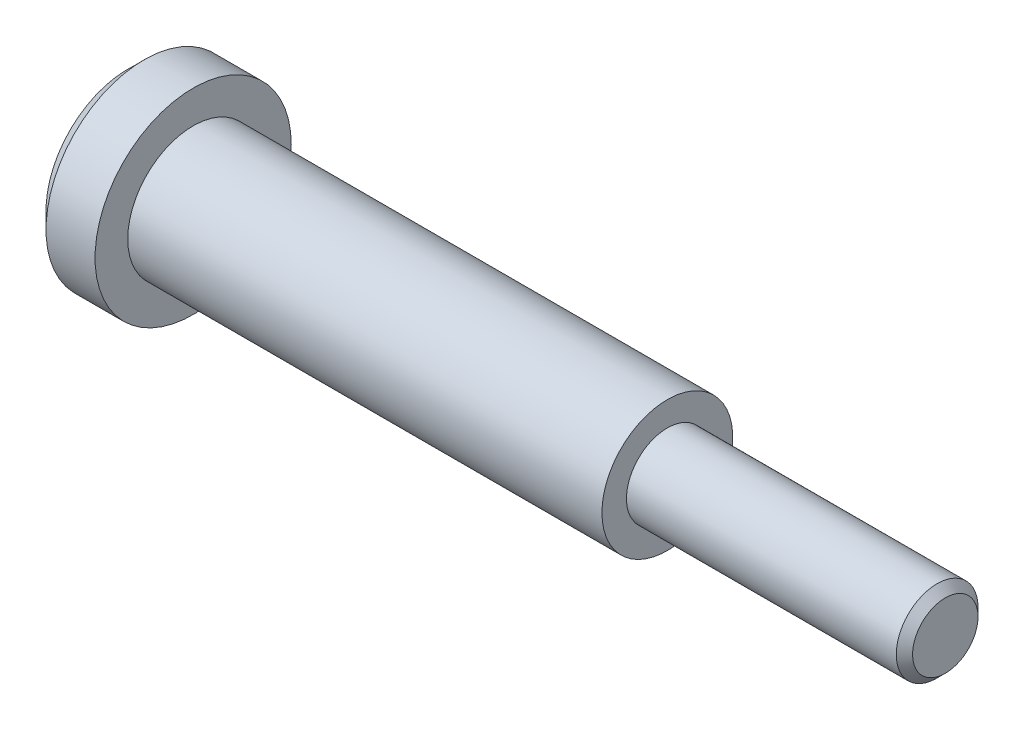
from build123d import *

# Parameters (mm, degrees)
SKETCH1_R           = 6
BOSS_EXTRUDE1_DEPTH = 4
SKETCH2_R           = 4
BOSS_EXTRUDE2_DEPTH = 29
SKETCH3_R           = 2.5
BOSS_EXTRUDE3_DEPTH = 17
CHAMFER1_SIZE       = 0.5
CHAMFER2_SIZE       = 1
SKETCH4_R           = 2.5
CUT_EXTRUDE1_DEPTH  = 1
FILLET1_R           = 0.5


with BuildPart() as part:
    # Sketch1 → Boss-Extrude1 (new body)
    with BuildSketch(Plane(origin=(0, 0, 0), x_dir=(0, 0, -1), z_dir=(1, 0, 0))):
        Circle(SKETCH1_R)
    extrude(amount=BOSS_EXTRUDE1_DEPTH)

    # Sketch2 → Boss-Extrude2 (add)
    with BuildSketch(Plane(origin=(4, 0, 0), x_dir=(0, 0, -1), z_dir=(1, 0, 0))):
        with Locations(Location((0, 0, 0), (0, 0, 180))):
            Circle(SKETCH2_R)
    extrude(amount=BOSS_EXTRUDE2_DEPTH)

    # Sketch3 → Boss-Extrude3 (add)
    with BuildSketch(Plane(origin=(33, 0, 0), x_dir=(0, 0, -1), z_dir=(1, 0, 0))):
        Circle(SKETCH3_R)
    extrude(amount=BOSS_EXTRUDE3_DEPTH)

    # Chamfer1
    chamfer1_edges = [part.edges().sort_by_distance(p)[0] for p in [
        (50, 0, 2.5),
    ]]
    chamfer(chamfer1_edges, length=CHAMFER1_SIZE)

    # Chamfer2
    chamfer2_edges = [part.edges().sort_by_distance(p)[0] for p in [
        (0, 0, 6),
    ]]
    chamfer(chamfer2_edges, length=CHAMFER2_SIZE)

    # Sketch4 → Cut-Extrude1 (cut)
    with BuildSketch(Plane.ZY):
        with Locations(Location((0, 0, 0), (0, 0, 180))):
            Circle(SKETCH4_R)
    extrude(amount=-CUT_EXTRUDE1_DEPTH, mode=Mode.SUBTRACT)

    # Fillet1
    fillet1_edges = [part.edges().sort_by_distance(p)[0] for p in [
        (0, 0, 2.5),
    ]]
    fillet(fillet1_edges, radius=FILLET1_R)


solid = part.part
